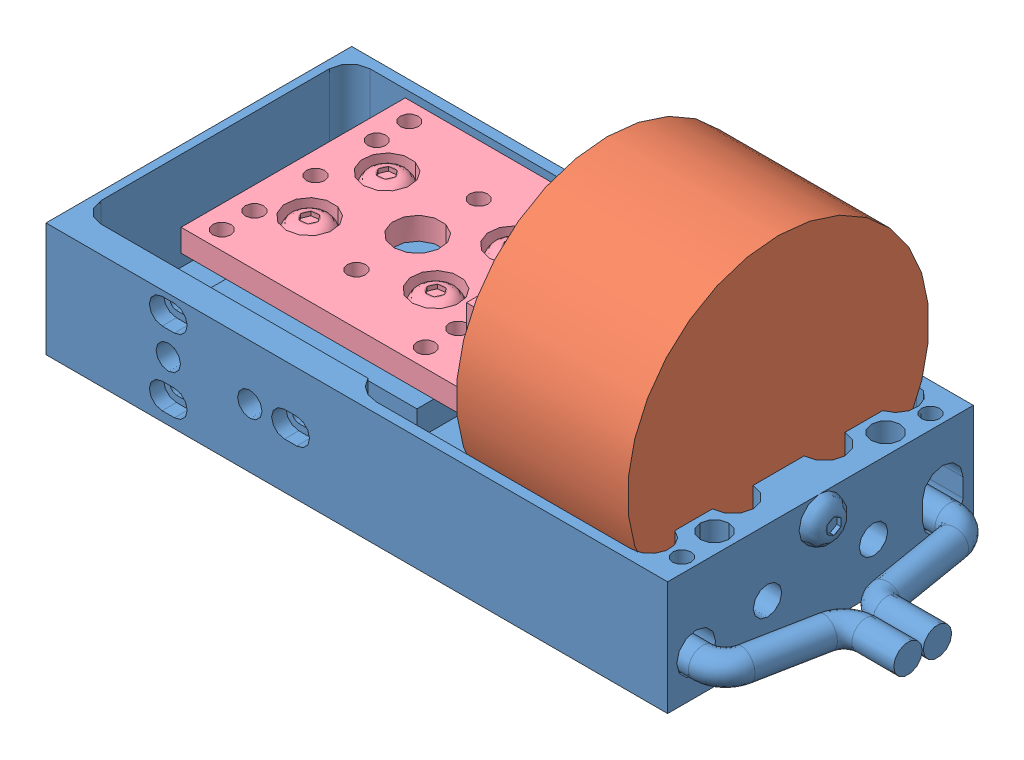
SolidWorks assembly VCS10.SLDASM, configuration Default (file format 4100). Lengths in mm.
Overall size (90.69 39.62 38.1).
4 component instances, 4 part files, 11 mates.
Components (placement in the parent):
- VCS10_base-1: VCS10_base.SLDPRT [Default] at origin size (90.69 14.22 38.1)
- VCS10_cup-1: VCS10_cup.SLDPRT [Default] at (51.054 6.604 -18.8676) x (0 0 1) z (0 -1 0) size (37.59 21.34 37.59)
- VCS10_bobbin-1: VCS10_bobbin.SLDPRT [Default] at (48.514 6.604 -18.8676) x (0 0 -1) z (0 1 0) size (27.94 19.81 27.94)
- VCS10_carriage-1: VCS10_carriage.SLDPRT [Default] at (11.938 0.254 -4.8976) size (36.58 11.18 27.94)
Mates (geometry in assembly coordinates):
- Tangent1: tangent anti-aligned: cylinder of VCS10_cup-1 through (51.054 6.604 -18.8676) axis (-1 0 0) radius 18.796; plane of VCS10_base-1 through (71.628 -12.192 -34.29) normal (0 1 0)
- Coincident1: coincident anti-aligned: plane of VCS10_cup-1 through (72.39 6.604 -18.8676) normal (1 0 0); plane of VCS10_base-1 through (72.39 -12.192 -22.098) normal (-1 0 0)
- Parallel1: parallel aligned: plane of VCS10_cup-1; plane of assembly
- Concentric1: concentric aligned: cylinder of VCS10_cup-1 through (51.054 6.604 -18.8676) axis (-1 0 0) radius 14.732; cylinder of VCS10_bobbin-1 through (48.514 6.604 -18.8676) axis (-1 0 0) radius 13.9446
- Coincident4: coincident anti-aligned: plane of VCS10_cup-1; plane of VCS10_bobbin-1
- Parallel2: parallel aligned: plane of VCS10_carriage-1 through (11.938 0.254 -4.8976) normal (0 0 1); plane of assembly
- Coincident7: coincident anti-aligned: plane of VCS10_bobbin-1 through (48.514 6.604 -24.9128) normal (-1 0 0); plane of VCS10_carriage-1 through (48.514 3.048 -32.8376) normal (1 0 0)
- Concentric2: concentric anti-aligned: cylinder of VCS10_bobbin-1 through (48.514 6.604 -9.4696) axis (-1 0 0) radius 1.1303; cylinder of VCS10_carriage-1 through (11.938 6.604 -9.4696) axis (1 0 0) radius 1.778
- Concentric3: concentric anti-aligned: cylinder of VCS10_bobbin-1 through (48.514 6.604 -28.2656) axis (-1 0 0) radius 1.1303; cylinder of VCS10_carriage-1 through (11.938 6.604 -28.2656) axis (1 0 0) radius 1.778
- LimitDistance1: limit distance = 10.922 mm anti-aligned: plane of VCS10_carriage-1 through (11.938 3.048 -32.8376) normal (-1 0 0); plane of VCS10_base-1 through (1.016 -12.192 -34.29) normal (1 0 0)
- Coincident9: coincident: line of VCS10_base-1 through (39.878 0 -1.27) axis (1 0 0); cylinder of VCS10_cup-1 through (51.054 6.604 -18.8676) axis (-1 0 0) radius 18.796
